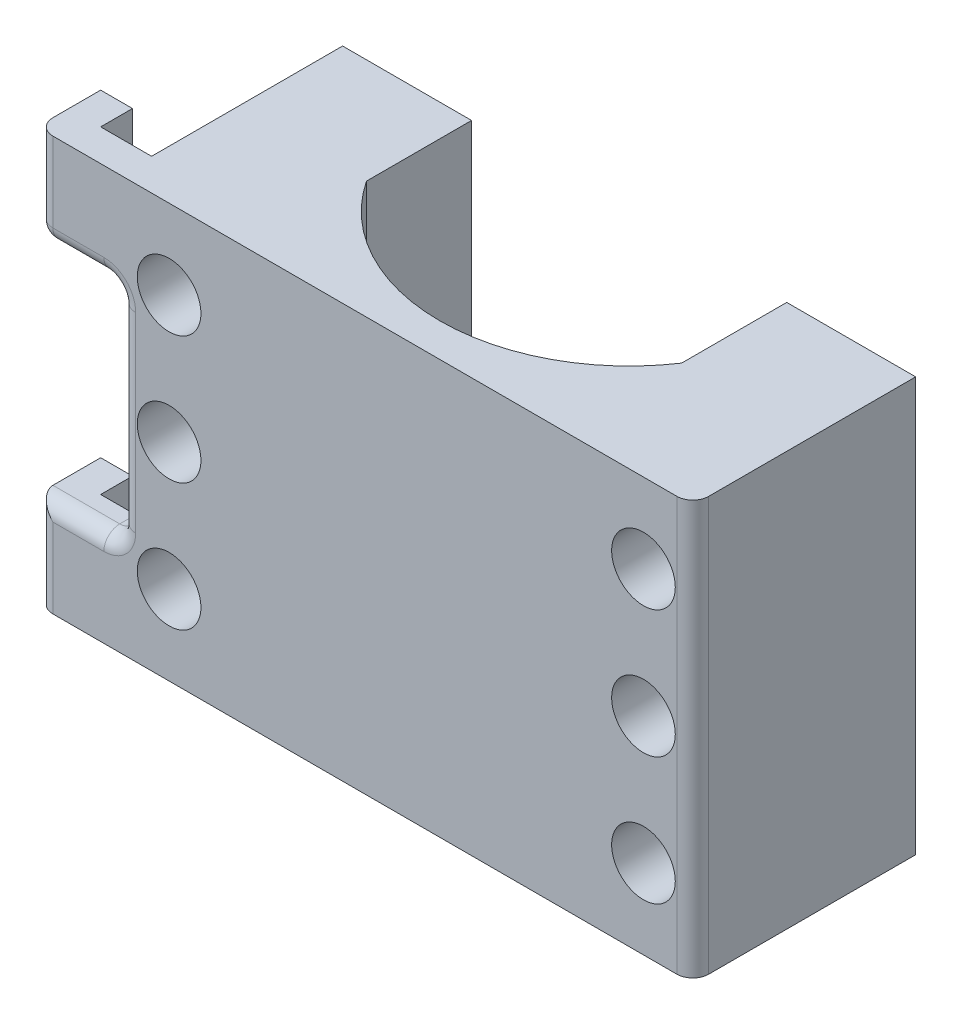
ISO-10303-21;
HEADER;
FILE_DESCRIPTION(('STEP AP214'),'2;1');
FILE_NAME('part.step','',(''),(''),'','','');
FILE_SCHEMA(('AUTOMOTIVE_DESIGN { 1 0 10303 214 1 1 1 1 }'));
ENDSEC;
DATA;
#1=APPLICATION_CONTEXT('core data for automotive mechanical design processes');
#2=APPLICATION_PROTOCOL_DEFINITION('international standard','automotive_design',2000,#1);
#3=PRODUCT_CONTEXT('',#1,'mechanical');
#4=PRODUCT('Part','Part','',(#3));
#5=PRODUCT_RELATED_PRODUCT_CATEGORY('part','',(#4));
#6=PRODUCT_DEFINITION_FORMATION('','',#4);
#7=PRODUCT_DEFINITION_CONTEXT('part definition',#1,'design');
#8=PRODUCT_DEFINITION('design','',#6,#7);
#9=PRODUCT_DEFINITION_SHAPE('','',#8);
#10=(LENGTH_UNIT() NAMED_UNIT(*) SI_UNIT(.MILLI.,.METRE.));
#11=(NAMED_UNIT(*) PLANE_ANGLE_UNIT() SI_UNIT($,.RADIAN.));
#12=(NAMED_UNIT(*) SI_UNIT($,.STERADIAN.) SOLID_ANGLE_UNIT());
#13=UNCERTAINTY_MEASURE_WITH_UNIT(LENGTH_MEASURE(1.E-05),#10,'distance_accuracy_value','');
#14=(GEOMETRIC_REPRESENTATION_CONTEXT(3) GLOBAL_UNCERTAINTY_ASSIGNED_CONTEXT((#13)) GLOBAL_UNIT_ASSIGNED_CONTEXT((#10,
#11,#12)) REPRESENTATION_CONTEXT('',''));
#15=CARTESIAN_POINT('',(0.,0.,0.));
#16=DIRECTION('',(0.,0.,1.));
#17=DIRECTION('',(1.,0.,0.));
#18=AXIS2_PLACEMENT_3D('',#15,#16,#17);
#19=CARTESIAN_POINT('',(-10.6,6.5,13.));
#20=DIRECTION('',(0.,0.,1.));
#21=DIRECTION('',(0.,-1.,0.));
#22=AXIS2_PLACEMENT_3D('',#19,#20,#21);
#23=PLANE('',#22);
#24=DIRECTION('',(0.,-1.,0.));
#25=VECTOR('',#24,1.);
#26=CARTESIAN_POINT('',(-10.6,6.5,13.));
#27=LINE('',#26,#25);
#28=CARTESIAN_POINT('',(-10.6,-3.5,13.));
#29=VERTEX_POINT('',#28);
#30=CARTESIAN_POINT('',(-10.6,-6.5,13.));
#31=VERTEX_POINT('',#30);
#32=EDGE_CURVE('E249',#29,#31,#27,.T.);
#33=ORIENTED_EDGE('',*,*,#32,.F.);
#34=DIRECTION('',(1.,0.,0.));
#35=VECTOR('',#34,1.);
#36=CARTESIAN_POINT('',(-10.6,-3.5,13.));
#37=LINE('',#36,#35);
#38=CARTESIAN_POINT('',(-9.5,-3.5,13.));
#39=VERTEX_POINT('',#38);
#40=EDGE_CURVE('E521',#29,#39,#37,.T.);
#41=ORIENTED_EDGE('',*,*,#40,.T.);
#42=CARTESIAN_POINT('',(-9.5,-3.,13.));
#43=DIRECTION('',(0.,0.,1.));
#44=DIRECTION('',(0.,-1.,0.));
#45=AXIS2_PLACEMENT_3D('',#42,#43,#44);
#46=CIRCLE('',#45,0.5);
#47=CARTESIAN_POINT('',(-9.,-3.,13.));
#48=VERTEX_POINT('',#47);
#49=EDGE_CURVE('E11',#39,#48,#46,.T.);
#50=ORIENTED_EDGE('',*,*,#49,.T.);
#51=DIRECTION('',(0.,-1.,0.));
#52=VECTOR('',#51,1.);
#53=CARTESIAN_POINT('',(-9.,6.5,13.));
#54=LINE('',#53,#52);
#55=CARTESIAN_POINT('',(-9.,-6.5,13.));
#56=VERTEX_POINT('',#55);
#57=EDGE_CURVE('E262',#48,#56,#54,.T.);
#58=ORIENTED_EDGE('',*,*,#57,.T.);
#59=DIRECTION('',(1.,0.,0.));
#60=VECTOR('',#59,1.);
#61=CARTESIAN_POINT('',(-10.6,-6.5,13.));
#62=LINE('',#61,#60);
#63=EDGE_CURVE('E248',#31,#56,#62,.T.);
#64=ORIENTED_EDGE('',*,*,#63,.F.);
#65=EDGE_LOOP('',(#33,#41,#50,#58,#64));
#66=FACE_BOUND('',#65,.T.);
#67=ADVANCED_FACE('F42',(#66),#23,.F.);
#68=CARTESIAN_POINT('',(-11.6,6.5,12.));
#69=DIRECTION('',(0.,0.,1.));
#70=DIRECTION('',(0.,-1.,0.));
#71=AXIS2_PLACEMENT_3D('',#68,#69,#70);
#72=PLANE('',#71);
#73=DIRECTION('',(0.,-1.,0.));
#74=VECTOR('',#73,1.);
#75=CARTESIAN_POINT('',(-11.6,6.5,12.));
#76=LINE('',#75,#74);
#77=CARTESIAN_POINT('',(-11.6,-3.5,12.));
#78=VERTEX_POINT('',#77);
#79=CARTESIAN_POINT('',(-11.6,-6.5,12.));
#80=VERTEX_POINT('',#79);
#81=EDGE_CURVE('E528',#78,#80,#76,.T.);
#82=ORIENTED_EDGE('',*,*,#81,.F.);
#83=DIRECTION('',(1.,0.,0.));
#84=VECTOR('',#83,1.);
#85=CARTESIAN_POINT('',(-11.6,-3.5,12.));
#86=LINE('',#85,#84);
#87=CARTESIAN_POINT('',(-10.6,-3.5,12.));
#88=VERTEX_POINT('',#87);
#89=EDGE_CURVE('E231',#78,#88,#86,.T.);
#90=ORIENTED_EDGE('',*,*,#89,.T.);
#91=DIRECTION('',(0.,-1.,0.));
#92=VECTOR('',#91,1.);
#93=CARTESIAN_POINT('',(-10.6,6.5,12.));
#94=LINE('',#93,#92);
#95=CARTESIAN_POINT('',(-10.6,-6.5,12.));
#96=VERTEX_POINT('',#95);
#97=EDGE_CURVE('E540',#88,#96,#94,.T.);
#98=ORIENTED_EDGE('',*,*,#97,.T.);
#99=DIRECTION('',(1.,0.,0.));
#100=VECTOR('',#99,1.);
#101=CARTESIAN_POINT('',(-11.6,-6.5,12.));
#102=LINE('',#101,#100);
#103=EDGE_CURVE('E537',#80,#96,#102,.T.);
#104=ORIENTED_EDGE('',*,*,#103,.F.);
#105=EDGE_LOOP('',(#82,#90,#98,#104));
#106=FACE_BOUND('',#105,.T.);
#107=ADVANCED_FACE('F628',(#106),#72,.F.);
#108=CARTESIAN_POINT('',(-11.6,0.,0.));
#109=DIRECTION('',(1.,0.,0.));
#110=DIRECTION('',(0.,0.,-1.));
#111=AXIS2_PLACEMENT_3D('',#108,#109,#110);
#112=PLANE('',#111);
#113=DIRECTION('',(0.,0.,1.));
#114=VECTOR('',#113,1.);
#115=CARTESIAN_POINT('',(-11.6,-6.5,14.));
#116=LINE('',#115,#114);
#117=CARTESIAN_POINT('',(-11.6,-6.5,13.5));
#118=VERTEX_POINT('',#117);
#119=EDGE_CURVE('E533',#80,#118,#116,.T.);
#120=ORIENTED_EDGE('',*,*,#119,.T.);
#121=DIRECTION('',(0.,1.,0.));
#122=VECTOR('',#121,1.);
#123=CARTESIAN_POINT('',(-11.6,-3.5,13.5));
#124=LINE('',#123,#122);
#125=CARTESIAN_POINT('',(-11.6,-3.5,13.5));
#126=VERTEX_POINT('',#125);
#127=EDGE_CURVE('E463',#118,#126,#124,.T.);
#128=ORIENTED_EDGE('',*,*,#127,.T.);
#129=DIRECTION('',(0.,0.,1.));
#130=VECTOR('',#129,1.);
#131=CARTESIAN_POINT('',(-11.6,-3.5,10.));
#132=LINE('',#131,#130);
#133=EDGE_CURVE('E505',#78,#126,#132,.T.);
#134=ORIENTED_EDGE('',*,*,#133,.F.);
#135=ORIENTED_EDGE('',*,*,#81,.T.);
#136=EDGE_LOOP('',(#120,#128,#134,#135));
#137=FACE_BOUND('',#136,.T.);
#138=ADVANCED_FACE('F619',(#137),#112,.F.);
#139=CARTESIAN_POINT('',(-10.6,0.,0.));
#140=DIRECTION('',(1.,0.,0.));
#141=DIRECTION('',(0.,0.,-1.));
#142=AXIS2_PLACEMENT_3D('',#139,#140,#141);
#143=PLANE('',#142);
#144=DIRECTION('',(0.,0.,-1.));
#145=VECTOR('',#144,1.);
#146=CARTESIAN_POINT('',(-10.6,-3.5,0.));
#147=LINE('',#146,#145);
#148=EDGE_CURVE('E242',#29,#88,#147,.T.);
#149=ORIENTED_EDGE('',*,*,#148,.F.);
#150=ORIENTED_EDGE('',*,*,#32,.T.);
#151=DIRECTION('',(0.,0.,1.));
#152=VECTOR('',#151,1.);
#153=CARTESIAN_POINT('',(-10.6,-6.5,14.));
#154=LINE('',#153,#152);
#155=EDGE_CURVE('E529',#96,#31,#154,.T.);
#156=ORIENTED_EDGE('',*,*,#155,.F.);
#157=ORIENTED_EDGE('',*,*,#97,.F.);
#158=EDGE_LOOP('',(#149,#150,#156,#157));
#159=FACE_BOUND('',#158,.T.);
#160=ADVANCED_FACE('F572',(#159),#143,.T.);
#161=CARTESIAN_POINT('',(0.,-6.5,14.));
#162=DIRECTION('',(0.,1.,0.));
#163=DIRECTION('',(0.,0.,1.));
#164=AXIS2_PLACEMENT_3D('',#161,#162,#163);
#165=PLANE('',#164);
#166=DIRECTION('',(0.,0.,-1.));
#167=VECTOR('',#166,1.);
#168=CARTESIAN_POINT('',(9.,-6.5,14.));
#169=LINE('',#168,#167);
#170=CARTESIAN_POINT('',(9.,-6.5,13.5));
#171=VERTEX_POINT('',#170);
#172=CARTESIAN_POINT('',(9.,-6.5,7.));
#173=VERTEX_POINT('',#172);
#174=EDGE_CURVE('E381',#171,#173,#169,.T.);
#175=ORIENTED_EDGE('',*,*,#174,.F.);
#176=CARTESIAN_POINT('',(8.5,-6.5,13.5));
#177=DIRECTION('',(0.,1.,0.));
#178=DIRECTION('',(0.,0.,1.));
#179=AXIS2_PLACEMENT_3D('',#176,#177,#178);
#180=CIRCLE('',#179,0.5);
#181=CARTESIAN_POINT('',(8.5,-6.5,14.));
#182=VERTEX_POINT('',#181);
#183=EDGE_CURVE('E453',#171,#182,#180,.F.);
#184=ORIENTED_EDGE('',*,*,#183,.T.);
#185=DIRECTION('',(1.,0.,0.));
#186=VECTOR('',#185,1.);
#187=CARTESIAN_POINT('',(0.,-6.5,14.));
#188=LINE('',#187,#186);
#189=CARTESIAN_POINT('',(-11.1,-6.5,14.));
#190=VERTEX_POINT('',#189);
#191=EDGE_CURVE('E364',#190,#182,#188,.T.);
#192=ORIENTED_EDGE('',*,*,#191,.F.);
#193=CARTESIAN_POINT('',(-11.1,-6.5,13.5));
#194=DIRECTION('',(0.,1.,0.));
#195=DIRECTION('',(0.,0.,1.));
#196=AXIS2_PLACEMENT_3D('',#193,#194,#195);
#197=CIRCLE('',#196,0.5);
#198=EDGE_CURVE('E450',#190,#118,#197,.F.);
#199=ORIENTED_EDGE('',*,*,#198,.T.);
#200=ORIENTED_EDGE('',*,*,#119,.F.);
#201=ORIENTED_EDGE('',*,*,#103,.T.);
#202=ORIENTED_EDGE('',*,*,#155,.T.);
#203=ORIENTED_EDGE('',*,*,#63,.T.);
#204=DIRECTION('',(0.,0.,-1.));
#205=VECTOR('',#204,1.);
#206=CARTESIAN_POINT('',(-9.,-6.5,14.));
#207=LINE('',#206,#205);
#208=CARTESIAN_POINT('',(-9.,-6.5,7.));
#209=VERTEX_POINT('',#208);
#210=EDGE_CURVE('E372',#56,#209,#207,.T.);
#211=ORIENTED_EDGE('',*,*,#210,.T.);
#212=DIRECTION('',(-1.,0.,0.));
#213=VECTOR('',#212,1.);
#214=CARTESIAN_POINT('',(9.,-6.5,7.));
#215=LINE('',#214,#213);
#216=CARTESIAN_POINT('',(-4.95,-6.5,7.));
#217=VERTEX_POINT('',#216);
#218=EDGE_CURVE('E278',#217,#209,#215,.T.);
#219=ORIENTED_EDGE('',*,*,#218,.F.);
#220=DIRECTION('',(0.,0.,-1.));
#221=VECTOR('',#220,1.);
#222=CARTESIAN_POINT('',(-4.95,-6.5,0.));
#223=LINE('',#222,#221);
#224=CARTESIAN_POINT('',(-4.95,-6.5,10.3015148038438));
#225=VERTEX_POINT('',#224);
#226=EDGE_CURVE('E310',#225,#217,#223,.T.);
#227=ORIENTED_EDGE('',*,*,#226,.F.);
#228=CARTESIAN_POINT('',(0.,-6.5,7.));
#229=DIRECTION('',(0.,1.,0.));
#230=DIRECTION('',(0.,0.,1.));
#231=AXIS2_PLACEMENT_3D('',#228,#229,#230);
#232=CIRCLE('',#231,5.95);
#233=CARTESIAN_POINT('',(4.95,-6.5,10.3015148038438));
#234=VERTEX_POINT('',#233);
#235=EDGE_CURVE('E314',#225,#234,#232,.T.);
#236=ORIENTED_EDGE('',*,*,#235,.T.);
#237=DIRECTION('',(0.,0.,-1.));
#238=VECTOR('',#237,1.);
#239=CARTESIAN_POINT('',(4.95,-6.5,0.));
#240=LINE('',#239,#238);
#241=CARTESIAN_POINT('',(4.95,-6.5,7.));
#242=VERTEX_POINT('',#241);
#243=EDGE_CURVE('E319',#234,#242,#240,.T.);
#244=ORIENTED_EDGE('',*,*,#243,.T.);
#245=EDGE_CURVE('E279',#173,#242,#215,.T.);
#246=ORIENTED_EDGE('',*,*,#245,.F.);
#247=EDGE_LOOP('',(#175,#184,#192,#199,#200,#201,#202,#203,#211,#219,#227,#236,#244,#246));
#248=FACE_BOUND('',#247,.T.);
#249=ADVANCED_FACE('F568',(#248),#165,.F.);
#250=CARTESIAN_POINT('',(0.,6.5,14.));
#251=DIRECTION('',(0.,1.,0.));
#252=DIRECTION('',(0.,0.,1.));
#253=AXIS2_PLACEMENT_3D('',#250,#251,#252);
#254=PLANE('',#253);
#255=DIRECTION('',(1.,0.,0.));
#256=VECTOR('',#255,1.);
#257=CARTESIAN_POINT('',(0.,6.5,14.));
#258=LINE('',#257,#256);
#259=CARTESIAN_POINT('',(-11.1,6.5,14.));
#260=VERTEX_POINT('',#259);
#261=CARTESIAN_POINT('',(8.5,6.5,14.));
#262=VERTEX_POINT('',#261);
#263=EDGE_CURVE('E368',#260,#262,#258,.T.);
#264=ORIENTED_EDGE('',*,*,#263,.T.);
#265=CARTESIAN_POINT('',(8.5,6.5,13.5));
#266=DIRECTION('',(0.,1.,0.));
#267=DIRECTION('',(0.,0.,1.));
#268=AXIS2_PLACEMENT_3D('',#265,#266,#267);
#269=CIRCLE('',#268,0.5);
#270=CARTESIAN_POINT('',(9.,6.5,13.5));
#271=VERTEX_POINT('',#270);
#272=EDGE_CURVE('E444',#262,#271,#269,.T.);
#273=ORIENTED_EDGE('',*,*,#272,.T.);
#274=DIRECTION('',(0.,0.,-1.));
#275=VECTOR('',#274,1.);
#276=CARTESIAN_POINT('',(9.,6.5,14.));
#277=LINE('',#276,#275);
#278=CARTESIAN_POINT('',(9.,6.5,7.));
#279=VERTEX_POINT('',#278);
#280=EDGE_CURVE('E378',#271,#279,#277,.T.);
#281=ORIENTED_EDGE('',*,*,#280,.T.);
#282=DIRECTION('',(1.,0.,0.));
#283=VECTOR('',#282,1.);
#284=CARTESIAN_POINT('',(9.,6.5,7.));
#285=LINE('',#284,#283);
#286=CARTESIAN_POINT('',(4.95,6.5,7.));
#287=VERTEX_POINT('',#286);
#288=EDGE_CURVE('E270',#287,#279,#285,.T.);
#289=ORIENTED_EDGE('',*,*,#288,.F.);
#290=DIRECTION('',(0.,0.,-1.));
#291=VECTOR('',#290,1.);
#292=CARTESIAN_POINT('',(4.95,6.5,0.));
#293=LINE('',#292,#291);
#294=CARTESIAN_POINT('',(4.95,6.5,10.3015148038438));
#295=VERTEX_POINT('',#294);
#296=EDGE_CURVE('E315',#295,#287,#293,.T.);
#297=ORIENTED_EDGE('',*,*,#296,.F.);
#298=CARTESIAN_POINT('',(0.,6.5,7.));
#299=DIRECTION('',(0.,1.,0.));
#300=DIRECTION('',(0.,0.,1.));
#301=AXIS2_PLACEMENT_3D('',#298,#299,#300);
#302=CIRCLE('',#301,5.95);
#303=CARTESIAN_POINT('',(-4.95,6.5,10.3015148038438));
#304=VERTEX_POINT('',#303);
#305=EDGE_CURVE('E327',#304,#295,#302,.T.);
#306=ORIENTED_EDGE('',*,*,#305,.F.);
#307=DIRECTION('',(0.,0.,-1.));
#308=VECTOR('',#307,1.);
#309=CARTESIAN_POINT('',(-4.95,6.5,0.));
#310=LINE('',#309,#308);
#311=CARTESIAN_POINT('',(-4.95,6.5,7.));
#312=VERTEX_POINT('',#311);
#313=EDGE_CURVE('E309',#304,#312,#310,.T.);
#314=ORIENTED_EDGE('',*,*,#313,.T.);
#315=CARTESIAN_POINT('',(-9.,6.5,7.));
#316=VERTEX_POINT('',#315);
#317=EDGE_CURVE('E271',#316,#312,#285,.T.);
#318=ORIENTED_EDGE('',*,*,#317,.F.);
#319=DIRECTION('',(0.,0.,-1.));
#320=VECTOR('',#319,1.);
#321=CARTESIAN_POINT('',(-9.,6.5,14.));
#322=LINE('',#321,#320);
#323=CARTESIAN_POINT('',(-9.,6.5,13.));
#324=VERTEX_POINT('',#323);
#325=EDGE_CURVE('E375',#324,#316,#322,.T.);
#326=ORIENTED_EDGE('',*,*,#325,.F.);
#327=DIRECTION('',(1.,0.,0.));
#328=VECTOR('',#327,1.);
#329=CARTESIAN_POINT('',(-10.6,6.5,13.));
#330=LINE('',#329,#328);
#331=CARTESIAN_POINT('',(-10.6,6.5,13.));
#332=VERTEX_POINT('',#331);
#333=EDGE_CURVE('E254',#332,#324,#330,.T.);
#334=ORIENTED_EDGE('',*,*,#333,.F.);
#335=DIRECTION('',(0.,0.,-1.));
#336=VECTOR('',#335,1.);
#337=CARTESIAN_POINT('',(-10.6,6.5,14.));
#338=LINE('',#337,#336);
#339=CARTESIAN_POINT('',(-10.6,6.5,12.));
#340=VERTEX_POINT('',#339);
#341=EDGE_CURVE('E246',#332,#340,#338,.T.);
#342=ORIENTED_EDGE('',*,*,#341,.T.);
#343=DIRECTION('',(1.,0.,0.));
#344=VECTOR('',#343,1.);
#345=CARTESIAN_POINT('',(-11.6,6.5,12.));
#346=LINE('',#345,#344);
#347=CARTESIAN_POINT('',(-11.6,6.5,12.));
#348=VERTEX_POINT('',#347);
#349=EDGE_CURVE('E259',#348,#340,#346,.T.);
#350=ORIENTED_EDGE('',*,*,#349,.F.);
#351=DIRECTION('',(0.,0.,-1.));
#352=VECTOR('',#351,1.);
#353=CARTESIAN_POINT('',(-11.6,6.5,14.));
#354=LINE('',#353,#352);
#355=CARTESIAN_POINT('',(-11.6,6.5,13.5));
#356=VERTEX_POINT('',#355);
#357=EDGE_CURVE('E525',#356,#348,#354,.T.);
#358=ORIENTED_EDGE('',*,*,#357,.F.);
#359=CARTESIAN_POINT('',(-11.1,6.5,13.5));
#360=DIRECTION('',(0.,1.,0.));
#361=DIRECTION('',(0.,0.,1.));
#362=AXIS2_PLACEMENT_3D('',#359,#360,#361);
#363=CIRCLE('',#362,0.5);
#364=EDGE_CURVE('E441',#356,#260,#363,.T.);
#365=ORIENTED_EDGE('',*,*,#364,.T.);
#366=EDGE_LOOP('',(#264,#273,#281,#289,#297,#306,#314,#318,#326,#334,#342,#350,#358,#365));
#367=FACE_BOUND('',#366,.T.);
#368=ADVANCED_FACE('F613',(#367),#254,.T.);
#369=CARTESIAN_POINT('',(9.,0.,14.));
#370=DIRECTION('',(-1.,0.,0.));
#371=DIRECTION('',(0.,0.,1.));
#372=AXIS2_PLACEMENT_3D('',#369,#370,#371);
#373=PLANE('',#372);
#374=ORIENTED_EDGE('',*,*,#280,.F.);
#375=DIRECTION('',(0.,1.,0.));
#376=VECTOR('',#375,1.);
#377=CARTESIAN_POINT('',(9.,-6.5,13.5));
#378=LINE('',#377,#376);
#379=EDGE_CURVE('E447',#271,#171,#378,.F.);
#380=ORIENTED_EDGE('',*,*,#379,.T.);
#381=ORIENTED_EDGE('',*,*,#174,.T.);
#382=DIRECTION('',(0.,-1.,0.));
#383=VECTOR('',#382,1.);
#384=CARTESIAN_POINT('',(9.,-6.5,7.));
#385=LINE('',#384,#383);
#386=EDGE_CURVE('E274',#279,#173,#385,.T.);
#387=ORIENTED_EDGE('',*,*,#386,.F.);
#388=EDGE_LOOP('',(#374,#380,#381,#387));
#389=FACE_BOUND('',#388,.T.);
#390=ADVANCED_FACE('F694',(#389),#373,.F.);
#391=CARTESIAN_POINT('',(-9.,0.,14.));
#392=DIRECTION('',(-1.,0.,0.));
#393=DIRECTION('',(0.,0.,1.));
#394=AXIS2_PLACEMENT_3D('',#391,#392,#393);
#395=PLANE('',#394);
#396=DIRECTION('',(0.,0.,1.));
#397=VECTOR('',#396,1.);
#398=CARTESIAN_POINT('',(-9.,3.,14.));
#399=LINE('',#398,#397);
#400=CARTESIAN_POINT('',(-9.,3.,13.5));
#401=VERTEX_POINT('',#400);
#402=CARTESIAN_POINT('',(-9.,3.,13.));
#403=VERTEX_POINT('',#402);
#404=EDGE_CURVE('E437',#401,#403,#399,.F.);
#405=ORIENTED_EDGE('',*,*,#404,.T.);
#406=EDGE_CURVE('E256',#324,#403,#54,.T.);
#407=ORIENTED_EDGE('',*,*,#406,.F.);
#408=ORIENTED_EDGE('',*,*,#325,.T.);
#409=DIRECTION('',(0.,1.,0.));
#410=VECTOR('',#409,1.);
#411=CARTESIAN_POINT('',(-9.,-6.5,7.));
#412=LINE('',#411,#410);
#413=EDGE_CURVE('E266',#209,#316,#412,.T.);
#414=ORIENTED_EDGE('',*,*,#413,.F.);
#415=ORIENTED_EDGE('',*,*,#210,.F.);
#416=ORIENTED_EDGE('',*,*,#57,.F.);
#417=DIRECTION('',(0.,0.,-1.));
#418=VECTOR('',#417,1.);
#419=CARTESIAN_POINT('',(-9.,-3.,14.));
#420=LINE('',#419,#418);
#421=CARTESIAN_POINT('',(-9.,-3.,13.5));
#422=VERTEX_POINT('',#421);
#423=EDGE_CURVE('E431',#48,#422,#420,.F.);
#424=ORIENTED_EDGE('',*,*,#423,.T.);
#425=DIRECTION('',(0.,-1.,0.));
#426=VECTOR('',#425,1.);
#427=CARTESIAN_POINT('',(-9.,0.,13.5));
#428=LINE('',#427,#426);
#429=EDGE_CURVE('E434',#422,#401,#428,.F.);
#430=ORIENTED_EDGE('',*,*,#429,.T.);
#431=EDGE_LOOP('',(#405,#407,#408,#414,#415,#416,#424,#430));
#432=FACE_BOUND('',#431,.T.);
#433=ADVANCED_FACE('F564',(#432),#395,.T.);
#434=CARTESIAN_POINT('',(0.,0.,14.));
#435=DIRECTION('',(0.,0.,1.));
#436=DIRECTION('',(1.,0.,0.));
#437=AXIS2_PLACEMENT_3D('',#434,#435,#436);
#438=PLANE('',#437);
#439=ORIENTED_EDGE('',*,*,#191,.T.);
#440=DIRECTION('',(0.,1.,0.));
#441=VECTOR('',#440,1.);
#442=CARTESIAN_POINT('',(8.5,6.5,14.));
#443=LINE('',#442,#441);
#444=EDGE_CURVE('E421',#182,#262,#443,.T.);
#445=ORIENTED_EDGE('',*,*,#444,.T.);
#446=ORIENTED_EDGE('',*,*,#263,.F.);
#447=DIRECTION('',(0.,1.,0.));
#448=VECTOR('',#447,1.);
#449=CARTESIAN_POINT('',(-11.1,3.5,14.));
#450=LINE('',#449,#448);
#451=CARTESIAN_POINT('',(-11.1,4.,14.));
#452=VERTEX_POINT('',#451);
#453=EDGE_CURVE('E418',#260,#452,#450,.F.);
#454=ORIENTED_EDGE('',*,*,#453,.T.);
#455=DIRECTION('',(-1.,0.,0.));
#456=VECTOR('',#455,1.);
#457=CARTESIAN_POINT('',(-9.,4.,14.));
#458=LINE('',#457,#456);
#459=CARTESIAN_POINT('',(-9.5,4.,14.));
#460=VERTEX_POINT('',#459);
#461=EDGE_CURVE('E415',#452,#460,#458,.F.);
#462=ORIENTED_EDGE('',*,*,#461,.T.);
#463=CARTESIAN_POINT('',(-9.5,3.,14.));
#464=DIRECTION('',(0.,0.,1.));
#465=DIRECTION('',(1.,0.,0.));
#466=AXIS2_PLACEMENT_3D('',#463,#464,#465);
#467=CIRCLE('',#466,1.);
#468=CARTESIAN_POINT('',(-8.5,3.,14.));
#469=VERTEX_POINT('',#468);
#470=EDGE_CURVE('E411',#469,#460,#467,.T.);
#471=ORIENTED_EDGE('',*,*,#470,.F.);
#472=DIRECTION('',(0.,-1.,0.));
#473=VECTOR('',#472,1.);
#474=CARTESIAN_POINT('',(-8.5,0.,14.));
#475=LINE('',#474,#473);
#476=CARTESIAN_POINT('',(-8.5,-3.,14.));
#477=VERTEX_POINT('',#476);
#478=EDGE_CURVE('E408',#469,#477,#475,.T.);
#479=ORIENTED_EDGE('',*,*,#478,.T.);
#480=CARTESIAN_POINT('',(-9.5,-3.,14.));
#481=DIRECTION('',(0.,0.,1.));
#482=DIRECTION('',(1.,0.,0.));
#483=AXIS2_PLACEMENT_3D('',#480,#481,#482);
#484=CIRCLE('',#483,1.);
#485=CARTESIAN_POINT('',(-9.5,-4.,14.));
#486=VERTEX_POINT('',#485);
#487=EDGE_CURVE('E404',#486,#477,#484,.T.);
#488=ORIENTED_EDGE('',*,*,#487,.F.);
#489=DIRECTION('',(-1.,0.,0.));
#490=VECTOR('',#489,1.);
#491=CARTESIAN_POINT('',(-11.6,-4.,14.));
#492=LINE('',#491,#490);
#493=CARTESIAN_POINT('',(-11.1,-4.,14.));
#494=VERTEX_POINT('',#493);
#495=EDGE_CURVE('E401',#486,#494,#492,.T.);
#496=ORIENTED_EDGE('',*,*,#495,.T.);
#497=DIRECTION('',(0.,1.,0.));
#498=VECTOR('',#497,1.);
#499=CARTESIAN_POINT('',(-11.1,-6.5,14.));
#500=LINE('',#499,#498);
#501=EDGE_CURVE('E398',#494,#190,#500,.F.);
#502=ORIENTED_EDGE('',*,*,#501,.T.);
#503=EDGE_LOOP('',(#439,#445,#446,#454,#462,#471,#479,#488,#496,#502));
#504=FACE_BOUND('',#503,.T.);
#505=CARTESIAN_POINT('',(-7.45,-4.,14.));
#506=DIRECTION('',(0.,0.,1.));
#507=DIRECTION('',(-1.,0.,0.));
#508=AXIS2_PLACEMENT_3D('',#505,#506,#507);
#509=CIRCLE('',#508,1.);
#510=CARTESIAN_POINT('',(-8.45,-4.,14.));
#511=VERTEX_POINT('',#510);
#512=EDGE_CURVE('E345',#511,#511,#509,.T.);
#513=ORIENTED_EDGE('',*,*,#512,.F.);
#514=EDGE_LOOP('',(#513));
#515=FACE_BOUND('',#514,.T.);
#516=CARTESIAN_POINT('',(7.45,-4.,14.));
#517=DIRECTION('',(0.,0.,1.));
#518=DIRECTION('',(1.,0.,0.));
#519=AXIS2_PLACEMENT_3D('',#516,#517,#518);
#520=CIRCLE('',#519,1.);
#521=CARTESIAN_POINT('',(8.45,-4.,14.));
#522=VERTEX_POINT('',#521);
#523=EDGE_CURVE('E350',#522,#522,#520,.T.);
#524=ORIENTED_EDGE('',*,*,#523,.F.);
#525=EDGE_LOOP('',(#524));
#526=FACE_BOUND('',#525,.T.);
#527=CARTESIAN_POINT('',(7.45,4.,14.));
#528=DIRECTION('',(0.,0.,1.));
#529=DIRECTION('',(-1.,0.,0.));
#530=AXIS2_PLACEMENT_3D('',#527,#528,#529);
#531=CIRCLE('',#530,1.);
#532=CARTESIAN_POINT('',(6.45,4.,14.));
#533=VERTEX_POINT('',#532);
#534=EDGE_CURVE('E354',#533,#533,#531,.T.);
#535=ORIENTED_EDGE('',*,*,#534,.F.);
#536=EDGE_LOOP('',(#535));
#537=FACE_BOUND('',#536,.T.);
#538=CARTESIAN_POINT('',(-7.45,0.,14.));
#539=DIRECTION('',(0.,0.,1.));
#540=DIRECTION('',(1.,0.,0.));
#541=AXIS2_PLACEMENT_3D('',#538,#539,#540);
#542=CIRCLE('',#541,1.);
#543=CARTESIAN_POINT('',(-6.45,0.,14.));
#544=VERTEX_POINT('',#543);
#545=EDGE_CURVE('E344',#544,#544,#542,.T.);
#546=ORIENTED_EDGE('',*,*,#545,.F.);
#547=EDGE_LOOP('',(#546));
#548=FACE_BOUND('',#547,.T.);
#549=CARTESIAN_POINT('',(7.45,0.,14.));
#550=DIRECTION('',(0.,0.,1.));
#551=DIRECTION('',(-1.,0.,0.));
#552=AXIS2_PLACEMENT_3D('',#549,#550,#551);
#553=CIRCLE('',#552,1.);
#554=CARTESIAN_POINT('',(6.45,0.,14.));
#555=VERTEX_POINT('',#554);
#556=EDGE_CURVE('E337',#555,#555,#553,.T.);
#557=ORIENTED_EDGE('',*,*,#556,.F.);
#558=EDGE_LOOP('',(#557));
#559=FACE_BOUND('',#558,.T.);
#560=CARTESIAN_POINT('',(-7.45,4.,14.));
#561=DIRECTION('',(0.,0.,1.));
#562=DIRECTION('',(1.,0.,0.));
#563=AXIS2_PLACEMENT_3D('',#560,#561,#562);
#564=CIRCLE('',#563,1.);
#565=CARTESIAN_POINT('',(-6.45,4.,14.));
#566=VERTEX_POINT('',#565);
#567=EDGE_CURVE('E349',#566,#566,#564,.T.);
#568=ORIENTED_EDGE('',*,*,#567,.F.);
#569=EDGE_LOOP('',(#568));
#570=FACE_BOUND('',#569,.T.);
#571=ADVANCED_FACE('F608',(#504,#515,#526,#537,#548,#559,#570),#438,.T.);
#572=CARTESIAN_POINT('',(-7.45,4.,0.));
#573=DIRECTION('',(0.,0.,1.));
#574=DIRECTION('',(1.,0.,0.));
#575=AXIS2_PLACEMENT_3D('',#572,#573,#574);
#576=CYLINDRICAL_SURFACE('',#575,1.);
#577=CARTESIAN_POINT('',(-7.45,4.,7.));
#578=DIRECTION('',(0.,0.,1.));
#579=DIRECTION('',(1.,0.,0.));
#580=AXIS2_PLACEMENT_3D('',#577,#578,#579);
#581=CIRCLE('',#580,1.);
#582=CARTESIAN_POINT('',(-6.45,4.,7.));
#583=VERTEX_POINT('',#582);
#584=EDGE_CURVE('E305',#583,#583,#581,.F.);
#585=ORIENTED_EDGE('',*,*,#584,.T.);
#586=EDGE_LOOP('',(#585));
#587=FACE_BOUND('',#586,.T.);
#588=ORIENTED_EDGE('',*,*,#567,.T.);
#589=EDGE_LOOP('',(#588));
#590=FACE_BOUND('',#589,.T.);
#591=ADVANCED_FACE('F672',(#587,#590),#576,.F.);
#592=CARTESIAN_POINT('',(7.45,0.,0.));
#593=DIRECTION('',(0.,0.,1.));
#594=DIRECTION('',(1.,0.,0.));
#595=AXIS2_PLACEMENT_3D('',#592,#593,#594);
#596=CYLINDRICAL_SURFACE('',#595,1.);
#597=CARTESIAN_POINT('',(7.45,0.,7.));
#598=DIRECTION('',(0.,0.,1.));
#599=DIRECTION('',(1.,0.,0.));
#600=AXIS2_PLACEMENT_3D('',#597,#598,#599);
#601=CIRCLE('',#600,1.);
#602=CARTESIAN_POINT('',(8.45,0.,7.));
#603=VERTEX_POINT('',#602);
#604=EDGE_CURVE('E301',#603,#603,#601,.F.);
#605=ORIENTED_EDGE('',*,*,#604,.T.);
#606=EDGE_LOOP('',(#605));
#607=FACE_BOUND('',#606,.T.);
#608=ORIENTED_EDGE('',*,*,#556,.T.);
#609=EDGE_LOOP('',(#608));
#610=FACE_BOUND('',#609,.T.);
#611=ADVANCED_FACE('F668',(#607,#610),#596,.F.);
#612=CARTESIAN_POINT('',(-7.45,0.,0.));
#613=DIRECTION('',(0.,0.,1.));
#614=DIRECTION('',(1.,0.,0.));
#615=AXIS2_PLACEMENT_3D('',#612,#613,#614);
#616=CYLINDRICAL_SURFACE('',#615,1.);
#617=CARTESIAN_POINT('',(-7.45,0.,7.));
#618=DIRECTION('',(0.,0.,1.));
#619=DIRECTION('',(1.,0.,0.));
#620=AXIS2_PLACEMENT_3D('',#617,#618,#619);
#621=CIRCLE('',#620,1.);
#622=CARTESIAN_POINT('',(-6.45,0.,7.));
#623=VERTEX_POINT('',#622);
#624=EDGE_CURVE('E297',#623,#623,#621,.F.);
#625=ORIENTED_EDGE('',*,*,#624,.T.);
#626=EDGE_LOOP('',(#625));
#627=FACE_BOUND('',#626,.T.);
#628=ORIENTED_EDGE('',*,*,#545,.T.);
#629=EDGE_LOOP('',(#628));
#630=FACE_BOUND('',#629,.T.);
#631=ADVANCED_FACE('F671',(#627,#630),#616,.F.);
#632=CARTESIAN_POINT('',(7.45,4.,0.));
#633=DIRECTION('',(0.,0.,1.));
#634=DIRECTION('',(1.,0.,0.));
#635=AXIS2_PLACEMENT_3D('',#632,#633,#634);
#636=CYLINDRICAL_SURFACE('',#635,1.);
#637=CARTESIAN_POINT('',(7.45,4.,7.));
#638=DIRECTION('',(0.,0.,1.));
#639=DIRECTION('',(1.,0.,0.));
#640=AXIS2_PLACEMENT_3D('',#637,#638,#639);
#641=CIRCLE('',#640,1.);
#642=CARTESIAN_POINT('',(8.45,4.,7.));
#643=VERTEX_POINT('',#642);
#644=EDGE_CURVE('E293',#643,#643,#641,.F.);
#645=ORIENTED_EDGE('',*,*,#644,.T.);
#646=EDGE_LOOP('',(#645));
#647=FACE_BOUND('',#646,.T.);
#648=ORIENTED_EDGE('',*,*,#534,.T.);
#649=EDGE_LOOP('',(#648));
#650=FACE_BOUND('',#649,.T.);
#651=ADVANCED_FACE('F680',(#647,#650),#636,.F.);
#652=CARTESIAN_POINT('',(7.45,-4.,0.));
#653=DIRECTION('',(0.,0.,1.));
#654=DIRECTION('',(1.,0.,0.));
#655=AXIS2_PLACEMENT_3D('',#652,#653,#654);
#656=CYLINDRICAL_SURFACE('',#655,1.);
#657=CARTESIAN_POINT('',(7.45,-4.,7.));
#658=DIRECTION('',(0.,0.,1.));
#659=DIRECTION('',(1.,0.,0.));
#660=AXIS2_PLACEMENT_3D('',#657,#658,#659);
#661=CIRCLE('',#660,1.);
#662=CARTESIAN_POINT('',(8.45,-4.,7.));
#663=VERTEX_POINT('',#662);
#664=EDGE_CURVE('E289',#663,#663,#661,.F.);
#665=ORIENTED_EDGE('',*,*,#664,.T.);
#666=EDGE_LOOP('',(#665));
#667=FACE_BOUND('',#666,.T.);
#668=ORIENTED_EDGE('',*,*,#523,.T.);
#669=EDGE_LOOP('',(#668));
#670=FACE_BOUND('',#669,.T.);
#671=ADVANCED_FACE('F676',(#667,#670),#656,.F.);
#672=CARTESIAN_POINT('',(-7.45,-4.,0.));
#673=DIRECTION('',(0.,0.,1.));
#674=DIRECTION('',(1.,0.,0.));
#675=AXIS2_PLACEMENT_3D('',#672,#673,#674);
#676=CYLINDRICAL_SURFACE('',#675,1.);
#677=CARTESIAN_POINT('',(-7.45,-4.,7.));
#678=DIRECTION('',(0.,0.,1.));
#679=DIRECTION('',(1.,0.,0.));
#680=AXIS2_PLACEMENT_3D('',#677,#678,#679);
#681=CIRCLE('',#680,1.);
#682=CARTESIAN_POINT('',(-6.45,-4.,7.));
#683=VERTEX_POINT('',#682);
#684=EDGE_CURVE('E285',#683,#683,#681,.F.);
#685=ORIENTED_EDGE('',*,*,#684,.T.);
#686=EDGE_LOOP('',(#685));
#687=FACE_BOUND('',#686,.T.);
#688=ORIENTED_EDGE('',*,*,#512,.T.);
#689=EDGE_LOOP('',(#688));
#690=FACE_BOUND('',#689,.T.);
#691=ADVANCED_FACE('F666',(#687,#690),#676,.F.);
#692=CARTESIAN_POINT('',(-4.95,-6.5,0.));
#693=DIRECTION('',(1.,0.,0.));
#694=DIRECTION('',(0.,0.,-1.));
#695=AXIS2_PLACEMENT_3D('',#692,#693,#694);
#696=PLANE('',#695);
#697=DIRECTION('',(0.,-1.,0.));
#698=VECTOR('',#697,1.);
#699=CARTESIAN_POINT('',(-4.95,-6.5,7.));
#700=LINE('',#699,#698);
#701=EDGE_CURVE('E282',#312,#217,#700,.T.);
#702=ORIENTED_EDGE('',*,*,#701,.F.);
#703=ORIENTED_EDGE('',*,*,#313,.F.);
#704=DIRECTION('',(0.,1.,0.));
#705=VECTOR('',#704,1.);
#706=CARTESIAN_POINT('',(-4.95,-6.5,10.3015148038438));
#707=LINE('',#706,#705);
#708=EDGE_CURVE('E323',#225,#304,#707,.T.);
#709=ORIENTED_EDGE('',*,*,#708,.F.);
#710=ORIENTED_EDGE('',*,*,#226,.T.);
#711=EDGE_LOOP('',(#702,#703,#709,#710));
#712=FACE_BOUND('',#711,.T.);
#713=ADVANCED_FACE('F662',(#712),#696,.T.);
#714=CARTESIAN_POINT('',(4.95,-6.5,0.));
#715=DIRECTION('',(1.,0.,0.));
#716=DIRECTION('',(0.,0.,-1.));
#717=AXIS2_PLACEMENT_3D('',#714,#715,#716);
#718=PLANE('',#717);
#719=ORIENTED_EDGE('',*,*,#296,.T.);
#720=DIRECTION('',(0.,-1.,0.));
#721=VECTOR('',#720,1.);
#722=CARTESIAN_POINT('',(4.95,-6.5,7.));
#723=LINE('',#722,#721);
#724=EDGE_CURVE('E243',#287,#242,#723,.T.);
#725=ORIENTED_EDGE('',*,*,#724,.T.);
#726=ORIENTED_EDGE('',*,*,#243,.F.);
#727=DIRECTION('',(0.,1.,0.));
#728=VECTOR('',#727,1.);
#729=CARTESIAN_POINT('',(4.95,-6.5,10.3015148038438));
#730=LINE('',#729,#728);
#731=EDGE_CURVE('E334',#234,#295,#730,.T.);
#732=ORIENTED_EDGE('',*,*,#731,.T.);
#733=EDGE_LOOP('',(#719,#725,#726,#732));
#734=FACE_BOUND('',#733,.T.);
#735=ADVANCED_FACE('F658',(#734),#718,.F.);
#736=CARTESIAN_POINT('',(0.,-6.5,7.));
#737=DIRECTION('',(0.,1.,0.));
#738=DIRECTION('',(0.,0.,1.));
#739=AXIS2_PLACEMENT_3D('',#736,#737,#738);
#740=CYLINDRICAL_SURFACE('',#739,5.95);
#741=ORIENTED_EDGE('',*,*,#305,.T.);
#742=ORIENTED_EDGE('',*,*,#731,.F.);
#743=ORIENTED_EDGE('',*,*,#235,.F.);
#744=ORIENTED_EDGE('',*,*,#708,.T.);
#745=EDGE_LOOP('',(#741,#742,#743,#744));
#746=FACE_BOUND('',#745,.T.);
#747=ADVANCED_FACE('F651',(#746),#740,.F.);
#748=CARTESIAN_POINT('',(0.,0.,7.));
#749=DIRECTION('',(0.,0.,1.));
#750=DIRECTION('',(1.,0.,0.));
#751=AXIS2_PLACEMENT_3D('',#748,#749,#750);
#752=PLANE('',#751);
#753=ORIENTED_EDGE('',*,*,#644,.F.);
#754=EDGE_LOOP('',(#753));
#755=FACE_BOUND('',#754,.T.);
#756=ORIENTED_EDGE('',*,*,#288,.T.);
#757=ORIENTED_EDGE('',*,*,#386,.T.);
#758=ORIENTED_EDGE('',*,*,#245,.T.);
#759=ORIENTED_EDGE('',*,*,#724,.F.);
#760=EDGE_LOOP('',(#756,#757,#758,#759));
#761=FACE_BOUND('',#760,.T.);
#762=ORIENTED_EDGE('',*,*,#664,.F.);
#763=EDGE_LOOP('',(#762));
#764=FACE_BOUND('',#763,.T.);
#765=ORIENTED_EDGE('',*,*,#604,.F.);
#766=EDGE_LOOP('',(#765));
#767=FACE_BOUND('',#766,.T.);
#768=ADVANCED_FACE('F646',(#755,#761,#764,#767),#752,.F.);
#769=ORIENTED_EDGE('',*,*,#624,.F.);
#770=EDGE_LOOP('',(#769));
#771=FACE_BOUND('',#770,.T.);
#772=ORIENTED_EDGE('',*,*,#701,.T.);
#773=ORIENTED_EDGE('',*,*,#218,.T.);
#774=ORIENTED_EDGE('',*,*,#413,.T.);
#775=ORIENTED_EDGE('',*,*,#317,.T.);
#776=EDGE_LOOP('',(#772,#773,#774,#775));
#777=FACE_BOUND('',#776,.T.);
#778=ORIENTED_EDGE('',*,*,#684,.F.);
#779=EDGE_LOOP('',(#778));
#780=FACE_BOUND('',#779,.T.);
#781=ORIENTED_EDGE('',*,*,#584,.F.);
#782=EDGE_LOOP('',(#781));
#783=FACE_BOUND('',#782,.T.);
#784=ADVANCED_FACE('F641',(#771,#777,#780,#783),#752,.F.);
#785=ORIENTED_EDGE('',*,*,#406,.T.);
#786=CARTESIAN_POINT('',(-9.5,3.,13.));
#787=DIRECTION('',(0.,0.,1.));
#788=DIRECTION('',(0.,-1.,0.));
#789=AXIS2_PLACEMENT_3D('',#786,#787,#788);
#790=CIRCLE('',#789,0.5);
#791=CARTESIAN_POINT('',(-9.5,3.5,13.));
#792=VERTEX_POINT('',#791);
#793=EDGE_CURVE('E52',#403,#792,#790,.T.);
#794=ORIENTED_EDGE('',*,*,#793,.T.);
#795=DIRECTION('',(-1.,0.,0.));
#796=VECTOR('',#795,1.);
#797=CARTESIAN_POINT('',(-10.6,3.5,13.));
#798=LINE('',#797,#796);
#799=CARTESIAN_POINT('',(-10.6,3.5,13.));
#800=VERTEX_POINT('',#799);
#801=EDGE_CURVE('E220',#792,#800,#798,.T.);
#802=ORIENTED_EDGE('',*,*,#801,.T.);
#803=EDGE_CURVE('E225',#332,#800,#27,.T.);
#804=ORIENTED_EDGE('',*,*,#803,.F.);
#805=ORIENTED_EDGE('',*,*,#333,.T.);
#806=EDGE_LOOP('',(#785,#794,#802,#804,#805));
#807=FACE_BOUND('',#806,.T.);
#808=ADVANCED_FACE('F222',(#807),#23,.F.);
#809=DIRECTION('',(-1.,0.,0.));
#810=VECTOR('',#809,1.);
#811=CARTESIAN_POINT('',(-11.6,3.5,12.));
#812=LINE('',#811,#810);
#813=CARTESIAN_POINT('',(-10.6,3.5,12.));
#814=VERTEX_POINT('',#813);
#815=CARTESIAN_POINT('',(-11.1,3.5,12.));
#816=VERTEX_POINT('',#815);
#817=EDGE_CURVE('E232',#814,#816,#812,.T.);
#818=ORIENTED_EDGE('',*,*,#817,.T.);
#819=CARTESIAN_POINT('',(-11.1,4.,12.));
#820=DIRECTION('',(0.,0.,1.));
#821=DIRECTION('',(0.,-1.,0.));
#822=AXIS2_PLACEMENT_3D('',#819,#820,#821);
#823=CIRCLE('',#822,0.5);
#824=CARTESIAN_POINT('',(-11.6,4.,12.));
#825=VERTEX_POINT('',#824);
#826=EDGE_CURVE('E68',#816,#825,#823,.F.);
#827=ORIENTED_EDGE('',*,*,#826,.T.);
#828=EDGE_CURVE('E530',#348,#825,#76,.T.);
#829=ORIENTED_EDGE('',*,*,#828,.F.);
#830=ORIENTED_EDGE('',*,*,#349,.T.);
#831=EDGE_CURVE('E541',#340,#814,#94,.T.);
#832=ORIENTED_EDGE('',*,*,#831,.T.);
#833=EDGE_LOOP('',(#818,#827,#829,#830,#832));
#834=FACE_BOUND('',#833,.T.);
#835=ADVANCED_FACE('F598',(#834),#72,.F.);
#836=DIRECTION('',(0.,0.,-1.));
#837=VECTOR('',#836,1.);
#838=CARTESIAN_POINT('',(-11.6,4.,0.));
#839=LINE('',#838,#837);
#840=CARTESIAN_POINT('',(-11.6,4.,13.5));
#841=VERTEX_POINT('',#840);
#842=EDGE_CURVE('E60',#825,#841,#839,.F.);
#843=ORIENTED_EDGE('',*,*,#842,.T.);
#844=DIRECTION('',(0.,1.,0.));
#845=VECTOR('',#844,1.);
#846=CARTESIAN_POINT('',(-11.6,6.5,13.5));
#847=LINE('',#846,#845);
#848=EDGE_CURVE('E458',#841,#356,#847,.T.);
#849=ORIENTED_EDGE('',*,*,#848,.T.);
#850=ORIENTED_EDGE('',*,*,#357,.T.);
#851=ORIENTED_EDGE('',*,*,#828,.T.);
#852=EDGE_LOOP('',(#843,#849,#850,#851));
#853=FACE_BOUND('',#852,.T.);
#854=ADVANCED_FACE('F616',(#853),#112,.F.);
#855=DIRECTION('',(0.,0.,1.));
#856=VECTOR('',#855,1.);
#857=CARTESIAN_POINT('',(-10.6,3.5,0.));
#858=LINE('',#857,#856);
#859=EDGE_CURVE('E235',#814,#800,#858,.T.);
#860=ORIENTED_EDGE('',*,*,#859,.F.);
#861=ORIENTED_EDGE('',*,*,#831,.F.);
#862=ORIENTED_EDGE('',*,*,#341,.F.);
#863=ORIENTED_EDGE('',*,*,#803,.T.);
#864=EDGE_LOOP('',(#860,#861,#862,#863));
#865=FACE_BOUND('',#864,.T.);
#866=ADVANCED_FACE('F245',(#865),#143,.T.);
#867=CARTESIAN_POINT('',(-0.937742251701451,-3.5,10.));
#868=DIRECTION('',(0.,-1.,0.));
#869=DIRECTION('',(0.,0.,-1.));
#870=AXIS2_PLACEMENT_3D('',#867,#868,#869);
#871=PLANE('',#870);
#872=ORIENTED_EDGE('',*,*,#133,.T.);
#873=DIRECTION('',(-1.,0.,0.));
#874=VECTOR('',#873,1.);
#875=CARTESIAN_POINT('',(-9.,-3.5,13.5));
#876=LINE('',#875,#874);
#877=CARTESIAN_POINT('',(-9.5,-3.5,13.5));
#878=VERTEX_POINT('',#877);
#879=EDGE_CURVE('E428',#126,#878,#876,.F.);
#880=ORIENTED_EDGE('',*,*,#879,.T.);
#881=DIRECTION('',(0.,0.,-1.));
#882=VECTOR('',#881,1.);
#883=CARTESIAN_POINT('',(-9.5,-3.5,10.));
#884=LINE('',#883,#882);
#885=EDGE_CURVE('E425',#878,#39,#884,.T.);
#886=ORIENTED_EDGE('',*,*,#885,.T.);
#887=ORIENTED_EDGE('',*,*,#40,.F.);
#888=ORIENTED_EDGE('',*,*,#148,.T.);
#889=ORIENTED_EDGE('',*,*,#89,.F.);
#890=EDGE_LOOP('',(#872,#880,#886,#887,#888,#889));
#891=FACE_BOUND('',#890,.T.);
#892=ADVANCED_FACE('F625',(#891),#871,.F.);
#893=CARTESIAN_POINT('',(-0.937742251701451,3.5,10.));
#894=DIRECTION('',(0.,1.,0.));
#895=DIRECTION('',(0.,0.,1.));
#896=AXIS2_PLACEMENT_3D('',#893,#894,#895);
#897=PLANE('',#896);
#898=DIRECTION('',(-1.,0.,0.));
#899=VECTOR('',#898,1.);
#900=CARTESIAN_POINT('',(-11.6,3.5,13.5));
#901=LINE('',#900,#899);
#902=CARTESIAN_POINT('',(-9.5,3.5,13.5));
#903=VERTEX_POINT('',#902);
#904=CARTESIAN_POINT('',(-11.1,3.5,13.5));
#905=VERTEX_POINT('',#904);
#906=EDGE_CURVE('E392',#903,#905,#901,.T.);
#907=ORIENTED_EDGE('',*,*,#906,.T.);
#908=DIRECTION('',(0.,0.,-1.));
#909=VECTOR('',#908,1.);
#910=CARTESIAN_POINT('',(-11.1,3.5,10.));
#911=LINE('',#910,#909);
#912=EDGE_CURVE('E395',#905,#816,#911,.T.);
#913=ORIENTED_EDGE('',*,*,#912,.T.);
#914=ORIENTED_EDGE('',*,*,#817,.F.);
#915=ORIENTED_EDGE('',*,*,#859,.T.);
#916=ORIENTED_EDGE('',*,*,#801,.F.);
#917=DIRECTION('',(0.,0.,1.));
#918=VECTOR('',#917,1.);
#919=CARTESIAN_POINT('',(-9.5,3.5,10.));
#920=LINE('',#919,#918);
#921=EDGE_CURVE('E389',#792,#903,#920,.T.);
#922=ORIENTED_EDGE('',*,*,#921,.T.);
#923=EDGE_LOOP('',(#907,#913,#914,#915,#916,#922));
#924=FACE_BOUND('',#923,.T.);
#925=ADVANCED_FACE('F237',(#924),#897,.F.);
#926=CARTESIAN_POINT('',(-11.1,0.,13.5));
#927=DIRECTION('',(0.,-1.,0.));
#928=DIRECTION('',(0.,0.,-1.));
#929=AXIS2_PLACEMENT_3D('',#926,#927,#928);
#930=CYLINDRICAL_SURFACE('',#929,0.5);
#931=ORIENTED_EDGE('',*,*,#198,.F.);
#932=ORIENTED_EDGE('',*,*,#501,.F.);
#933=CARTESIAN_POINT('',(-11.1,-4.,13.5));
#934=DIRECTION('',(-0.707106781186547,-0.707106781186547,0.));
#935=DIRECTION('',(0.707106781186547,-0.707106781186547,0.));
#936=AXIS2_PLACEMENT_3D('',#933,#934,#935);
#937=ELLIPSE('',#936,0.707106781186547,0.5);
#938=EDGE_CURVE('E46',#126,#494,#937,.F.);
#939=ORIENTED_EDGE('',*,*,#938,.F.);
#940=ORIENTED_EDGE('',*,*,#127,.F.);
#941=EDGE_LOOP('',(#931,#932,#939,#940));
#942=FACE_BOUND('',#941,.T.);
#943=ADVANCED_FACE('F723',(#942),#930,.T.);
#944=CARTESIAN_POINT('',(0.,-4.,13.5));
#945=DIRECTION('',(1.,0.,0.));
#946=DIRECTION('',(0.,0.,-1.));
#947=AXIS2_PLACEMENT_3D('',#944,#945,#946);
#948=CYLINDRICAL_SURFACE('',#947,0.5);
#949=ORIENTED_EDGE('',*,*,#938,.T.);
#950=ORIENTED_EDGE('',*,*,#495,.F.);
#951=CARTESIAN_POINT('',(-9.5,-4.,13.5));
#952=DIRECTION('',(1.,0.,0.));
#953=DIRECTION('',(0.,0.,-1.));
#954=AXIS2_PLACEMENT_3D('',#951,#952,#953);
#955=CIRCLE('',#954,0.5);
#956=EDGE_CURVE('E498',#878,#486,#955,.T.);
#957=ORIENTED_EDGE('',*,*,#956,.F.);
#958=ORIENTED_EDGE('',*,*,#879,.F.);
#959=EDGE_LOOP('',(#949,#950,#957,#958));
#960=FACE_BOUND('',#959,.T.);
#961=ADVANCED_FACE('F721',(#960),#948,.T.);
#962=CARTESIAN_POINT('',(-9.5,-3.,10.));
#963=DIRECTION('',(0.,0.,-1.));
#964=DIRECTION('',(-1.,0.,0.));
#965=AXIS2_PLACEMENT_3D('',#962,#963,#964);
#966=CYLINDRICAL_SURFACE('',#965,0.5);
#967=ORIENTED_EDGE('',*,*,#49,.F.);
#968=ORIENTED_EDGE('',*,*,#885,.F.);
#969=CARTESIAN_POINT('',(-9.5,-3.,13.5));
#970=DIRECTION('',(0.,0.,1.));
#971=DIRECTION('',(1.,0.,0.));
#972=AXIS2_PLACEMENT_3D('',#969,#970,#971);
#973=CIRCLE('',#972,0.5);
#974=EDGE_CURVE('E495',#422,#878,#973,.F.);
#975=ORIENTED_EDGE('',*,*,#974,.F.);
#976=ORIENTED_EDGE('',*,*,#423,.F.);
#977=EDGE_LOOP('',(#967,#968,#975,#976));
#978=FACE_BOUND('',#977,.T.);
#979=ADVANCED_FACE('F575',(#978),#966,.F.);
#980=CARTESIAN_POINT('',(-9.5,-3.,13.5));
#981=DIRECTION('',(0.,0.,1.));
#982=DIRECTION('',(1.,0.,0.));
#983=AXIS2_PLACEMENT_3D('',#980,#981,#982);
#984=TOROIDAL_SURFACE('',#983,1.,0.5);
#985=ORIENTED_EDGE('',*,*,#956,.T.);
#986=ORIENTED_EDGE('',*,*,#487,.T.);
#987=CARTESIAN_POINT('',(-8.5,-3.,13.5));
#988=DIRECTION('',(0.,-1.,0.));
#989=DIRECTION('',(0.,0.,-1.));
#990=AXIS2_PLACEMENT_3D('',#987,#988,#989);
#991=CIRCLE('',#990,0.5);
#992=EDGE_CURVE('E491',#422,#477,#991,.F.);
#993=ORIENTED_EDGE('',*,*,#992,.F.);
#994=ORIENTED_EDGE('',*,*,#974,.T.);
#995=EDGE_LOOP('',(#985,#986,#993,#994));
#996=FACE_BOUND('',#995,.T.);
#997=ADVANCED_FACE('F716',(#996),#984,.T.);
#998=CARTESIAN_POINT('',(-8.5,0.,13.5));
#999=DIRECTION('',(0.,-1.,0.));
#1000=DIRECTION('',(0.,0.,-1.));
#1001=AXIS2_PLACEMENT_3D('',#998,#999,#1000);
#1002=CYLINDRICAL_SURFACE('',#1001,0.5);
#1003=ORIENTED_EDGE('',*,*,#992,.T.);
#1004=ORIENTED_EDGE('',*,*,#478,.F.);
#1005=CARTESIAN_POINT('',(-8.5,3.,13.5));
#1006=DIRECTION('',(0.,1.,0.));
#1007=DIRECTION('',(0.,0.,1.));
#1008=AXIS2_PLACEMENT_3D('',#1005,#1006,#1007);
#1009=CIRCLE('',#1008,0.5);
#1010=EDGE_CURVE('E487',#401,#469,#1009,.T.);
#1011=ORIENTED_EDGE('',*,*,#1010,.F.);
#1012=ORIENTED_EDGE('',*,*,#429,.F.);
#1013=EDGE_LOOP('',(#1003,#1004,#1011,#1012));
#1014=FACE_BOUND('',#1013,.T.);
#1015=ADVANCED_FACE('F587',(#1014),#1002,.T.);
#1016=CARTESIAN_POINT('',(-9.5,3.,10.));
#1017=DIRECTION('',(0.,0.,1.));
#1018=DIRECTION('',(1.,0.,0.));
#1019=AXIS2_PLACEMENT_3D('',#1016,#1017,#1018);
#1020=CYLINDRICAL_SURFACE('',#1019,0.5);
#1021=ORIENTED_EDGE('',*,*,#793,.F.);
#1022=ORIENTED_EDGE('',*,*,#404,.F.);
#1023=CARTESIAN_POINT('',(-9.5,3.,13.5));
#1024=DIRECTION('',(0.,0.,1.));
#1025=DIRECTION('',(1.,0.,0.));
#1026=AXIS2_PLACEMENT_3D('',#1023,#1024,#1025);
#1027=CIRCLE('',#1026,0.5);
#1028=EDGE_CURVE('E483',#903,#401,#1027,.F.);
#1029=ORIENTED_EDGE('',*,*,#1028,.F.);
#1030=ORIENTED_EDGE('',*,*,#921,.F.);
#1031=EDGE_LOOP('',(#1021,#1022,#1029,#1030));
#1032=FACE_BOUND('',#1031,.T.);
#1033=ADVANCED_FACE('F584',(#1032),#1020,.F.);
#1034=CARTESIAN_POINT('',(-11.1,4.,10.));
#1035=DIRECTION('',(0.,0.,-1.));
#1036=DIRECTION('',(-1.,0.,0.));
#1037=AXIS2_PLACEMENT_3D('',#1034,#1035,#1036);
#1038=CYLINDRICAL_SURFACE('',#1037,0.5);
#1039=ORIENTED_EDGE('',*,*,#826,.F.);
#1040=ORIENTED_EDGE('',*,*,#912,.F.);
#1041=CARTESIAN_POINT('',(-11.1,4.,13.5));
#1042=DIRECTION('',(0.,0.,1.));
#1043=DIRECTION('',(1.,0.,0.));
#1044=AXIS2_PLACEMENT_3D('',#1041,#1042,#1043);
#1045=CIRCLE('',#1044,0.5);
#1046=EDGE_CURVE('E479',#841,#905,#1045,.T.);
#1047=ORIENTED_EDGE('',*,*,#1046,.F.);
#1048=ORIENTED_EDGE('',*,*,#842,.F.);
#1049=EDGE_LOOP('',(#1039,#1040,#1047,#1048));
#1050=FACE_BOUND('',#1049,.T.);
#1051=ADVANCED_FACE('F599',(#1050),#1038,.T.);
#1052=CARTESIAN_POINT('',(-11.1,0.,13.5));
#1053=DIRECTION('',(0.,-1.,0.));
#1054=DIRECTION('',(0.,0.,-1.));
#1055=AXIS2_PLACEMENT_3D('',#1052,#1053,#1054);
#1056=CYLINDRICAL_SURFACE('',#1055,0.5);
#1057=ORIENTED_EDGE('',*,*,#364,.F.);
#1058=ORIENTED_EDGE('',*,*,#848,.F.);
#1059=CARTESIAN_POINT('',(-11.1,4.,13.5));
#1060=DIRECTION('',(0.,-1.,0.));
#1061=DIRECTION('',(0.,0.,-1.));
#1062=AXIS2_PLACEMENT_3D('',#1059,#1060,#1061);
#1063=CIRCLE('',#1062,0.5);
#1064=EDGE_CURVE('E475',#452,#841,#1063,.T.);
#1065=ORIENTED_EDGE('',*,*,#1064,.F.);
#1066=ORIENTED_EDGE('',*,*,#453,.F.);
#1067=EDGE_LOOP('',(#1057,#1058,#1065,#1066));
#1068=FACE_BOUND('',#1067,.T.);
#1069=ADVANCED_FACE('F606',(#1068),#1056,.T.);
#1070=CARTESIAN_POINT('',(-9.5,3.,13.5));
#1071=DIRECTION('',(0.,0.,1.));
#1072=DIRECTION('',(1.,0.,0.));
#1073=AXIS2_PLACEMENT_3D('',#1070,#1071,#1072);
#1074=TOROIDAL_SURFACE('',#1073,1.,0.5);
#1075=ORIENTED_EDGE('',*,*,#1010,.T.);
#1076=ORIENTED_EDGE('',*,*,#470,.T.);
#1077=CARTESIAN_POINT('',(-9.5,4.,13.5));
#1078=DIRECTION('',(1.,0.,0.));
#1079=DIRECTION('',(0.,0.,-1.));
#1080=AXIS2_PLACEMENT_3D('',#1077,#1078,#1079);
#1081=CIRCLE('',#1080,0.5);
#1082=EDGE_CURVE('E471',#903,#460,#1081,.F.);
#1083=ORIENTED_EDGE('',*,*,#1082,.F.);
#1084=ORIENTED_EDGE('',*,*,#1028,.T.);
#1085=EDGE_LOOP('',(#1075,#1076,#1083,#1084));
#1086=FACE_BOUND('',#1085,.T.);
#1087=ADVANCED_FACE('F589',(#1086),#1074,.T.);
#1088=CARTESIAN_POINT('',(-11.1,4.,13.5));
#1089=DIRECTION('',(-1.,0.,0.));
#1090=DIRECTION('',(0.,0.,1.));
#1091=AXIS2_PLACEMENT_3D('',#1088,#1089,#1090);
#1092=SPHERICAL_SURFACE('',#1091,0.5);
#1093=ORIENTED_EDGE('',*,*,#1064,.T.);
#1094=ORIENTED_EDGE('',*,*,#1046,.T.);
#1095=CARTESIAN_POINT('',(-11.1,4.,13.5));
#1096=DIRECTION('',(-1.,0.,0.));
#1097=DIRECTION('',(0.,0.,1.));
#1098=AXIS2_PLACEMENT_3D('',#1095,#1096,#1097);
#1099=CIRCLE('',#1098,0.5);
#1100=EDGE_CURVE('E468',#452,#905,#1099,.F.);
#1101=ORIENTED_EDGE('',*,*,#1100,.F.);
#1102=EDGE_LOOP('',(#1093,#1094,#1101));
#1103=FACE_BOUND('',#1102,.T.);
#1104=ADVANCED_FACE('F602',(#1103),#1092,.T.);
#1105=CARTESIAN_POINT('',(-0.937742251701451,4.,13.5));
#1106=DIRECTION('',(1.,0.,0.));
#1107=DIRECTION('',(0.,0.,-1.));
#1108=AXIS2_PLACEMENT_3D('',#1105,#1106,#1107);
#1109=CYLINDRICAL_SURFACE('',#1108,0.5);
#1110=ORIENTED_EDGE('',*,*,#1082,.T.);
#1111=ORIENTED_EDGE('',*,*,#461,.F.);
#1112=ORIENTED_EDGE('',*,*,#1100,.T.);
#1113=ORIENTED_EDGE('',*,*,#906,.F.);
#1114=EDGE_LOOP('',(#1110,#1111,#1112,#1113));
#1115=FACE_BOUND('',#1114,.T.);
#1116=ADVANCED_FACE('F593',(#1115),#1109,.T.);
#1117=CARTESIAN_POINT('',(8.5,0.,13.5));
#1118=DIRECTION('',(0.,-1.,0.));
#1119=DIRECTION('',(0.,0.,-1.));
#1120=AXIS2_PLACEMENT_3D('',#1117,#1118,#1119);
#1121=CYLINDRICAL_SURFACE('',#1120,0.5);
#1122=ORIENTED_EDGE('',*,*,#183,.F.);
#1123=ORIENTED_EDGE('',*,*,#379,.F.);
#1124=ORIENTED_EDGE('',*,*,#272,.F.);
#1125=ORIENTED_EDGE('',*,*,#444,.F.);
#1126=EDGE_LOOP('',(#1122,#1123,#1124,#1125));
#1127=FACE_BOUND('',#1126,.T.);
#1128=ADVANCED_FACE('F44',(#1127),#1121,.T.);
#1129=CLOSED_SHELL('',(#67,#107,#138,#160,#249,#368,#390,#433,#571,#591,#611,#631,#651,#671,
#691,#713,#735,#747,#768,#784,#808,#835,#854,#866,#892,#925,#943,#961,#979,#997,#1015,#1033,
#1051,#1069,#1087,#1104,#1116,#1128));
#1130=MANIFOLD_SOLID_BREP('B2',#1129);
#1131=ADVANCED_BREP_SHAPE_REPRESENTATION('',(#18,#1130),#14);
#1132=SHAPE_DEFINITION_REPRESENTATION(#9,#1131);
ENDSEC;
END-ISO-10303-21;
